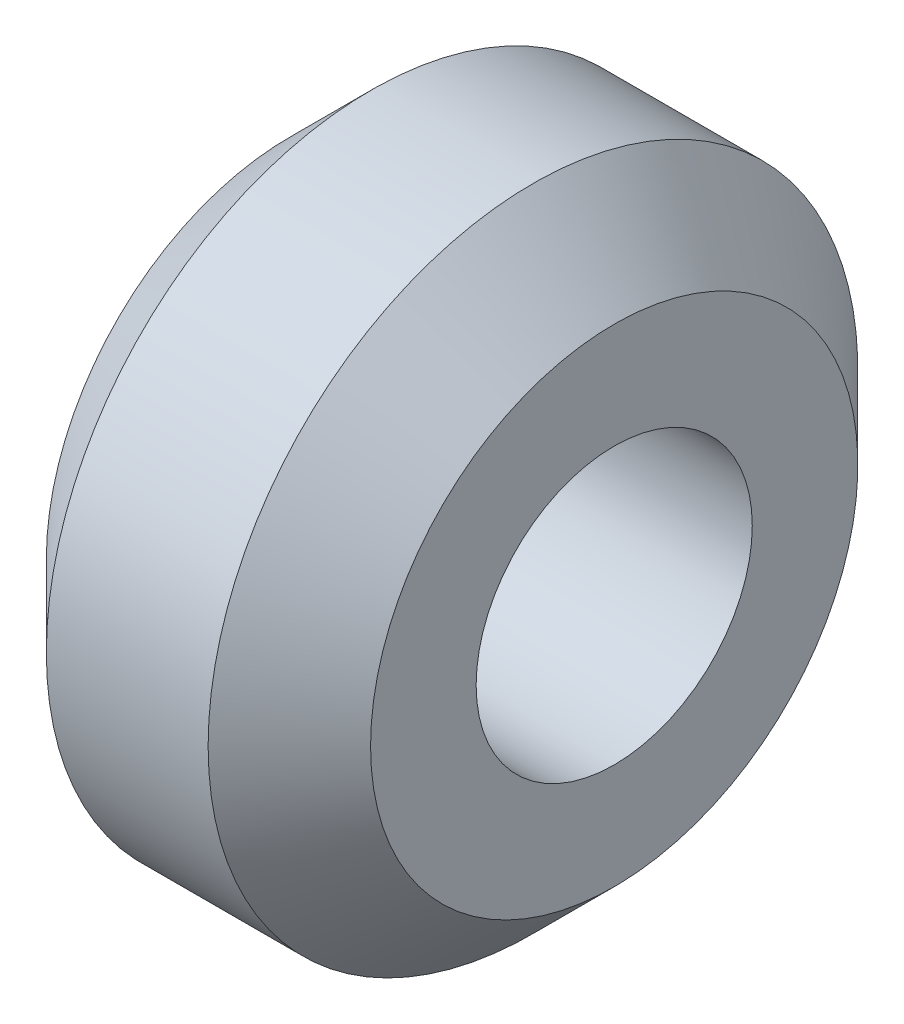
from build123d import *


with BuildPart() as part:
    # Esquisse1 → Base-R_volution (revolve)
    with BuildSketch(Plane.XY, mode=Mode.PRIVATE) as base_r_volution_sk:
        Polygon((11.01, 10), (15.99, 10), (18.49, 7.5), (18.49, 4.25), (8.51, 4.25), (8.51, 7.5), align=None)
    revolve(base_r_volution_sk.sketch.rotate(Axis((-50, 0, 0), (1, 0, 0)), 90), axis=Axis((-50, 0, 0), (1, 0, 0)))


solid = part.part
